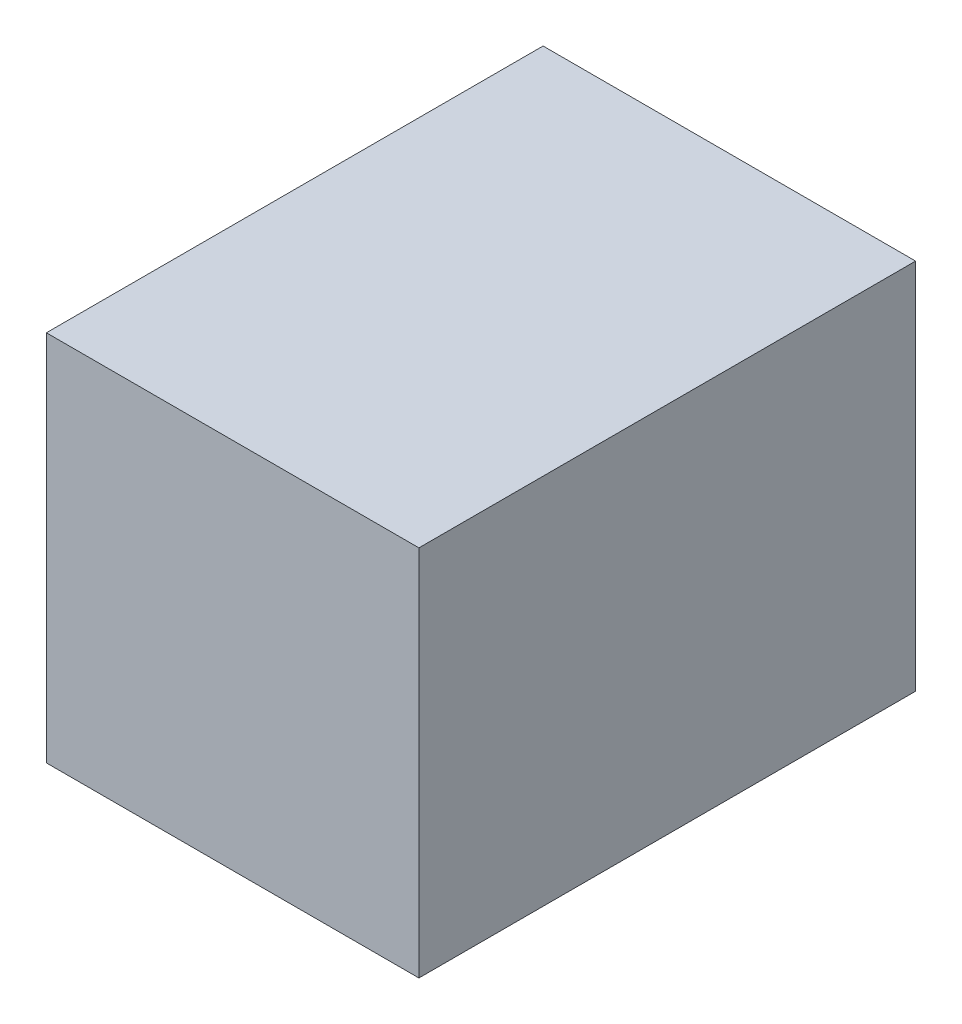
from build123d import *

# Parameters (mm, degrees)
BOSS_EXTRUDE1_DEPTH      = 300
BOSS_EXTRUDE1_DEPTH_BACK = 100
SKETCH1_W                = 300
SKETCH1_H                = 300
SHELL1_T                 = 5


with BuildPart() as part:
    # Sketch1 → Boss-Extrude1 (new, two sides: drawn at the far end of the back side and taken through both)
    with BuildSketch(Plane.XY.offset(-BOSS_EXTRUDE1_DEPTH_BACK)):
        Rectangle(SKETCH1_W, SKETCH1_H)
    extrude(amount=BOSS_EXTRUDE1_DEPTH + BOSS_EXTRUDE1_DEPTH_BACK)

    # Shell1 (no face opened: a closed hollow body)
    add(offset(amount=-SHELL1_T, mode=Mode.PRIVATE), mode=Mode.SUBTRACT)


solid = part.part
